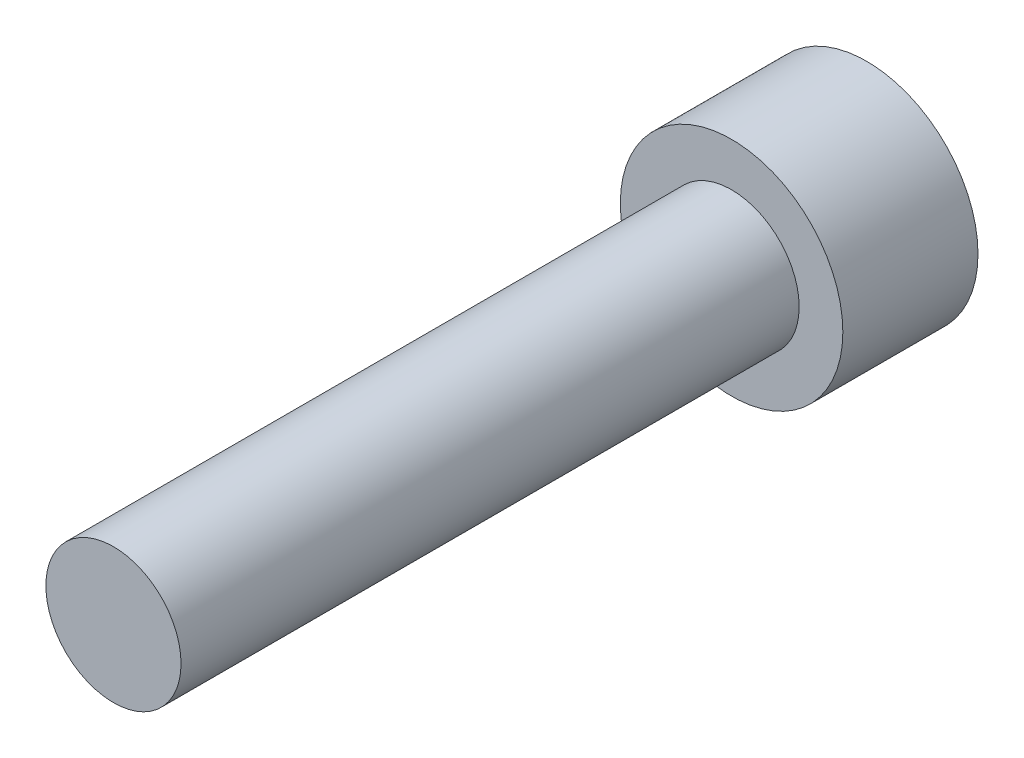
from build123d import *

# Parameters (mm, degrees)
HEX_2_DEPTH = 2.794


with BuildPart() as part:
    # Sketch6 → Revolve1 (revolve)
    with BuildSketch(Plane(origin=(0, 0, 0), x_dir=(0, 0, -1), z_dir=(1, 0, 0)), mode=Mode.PRIVATE) as revolve1_sk:
        Polygon((-19.05, 0), (-19.05, -2.0828), (0, -2.0828), (0, -3.429), (4.1656, -3.429), (4.1656, 0), align=None)
    revolve(revolve1_sk.sketch.rotate(Axis((0, 0, 19.05), (0, 0, -1)), 270), axis=Axis((0, 0, 19.05), (0, 0, -1)))

    # Sketch7 → HEX 2 (cut)
    with BuildSketch(Plane(origin=(0, 0, -4.1656), x_dir=(-1, 0, 0), z_dir=(0, 0, -1))):
        Polygon((-1.778, 1.026528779), (-1.778, -1.026528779), (0, -2.053057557), (1.778, -1.026528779), (1.778, 1.026528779), (0, 2.053057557), align=None)
    extrude(amount=-HEX_2_DEPTH, mode=Mode.SUBTRACT)


solid = part.part
